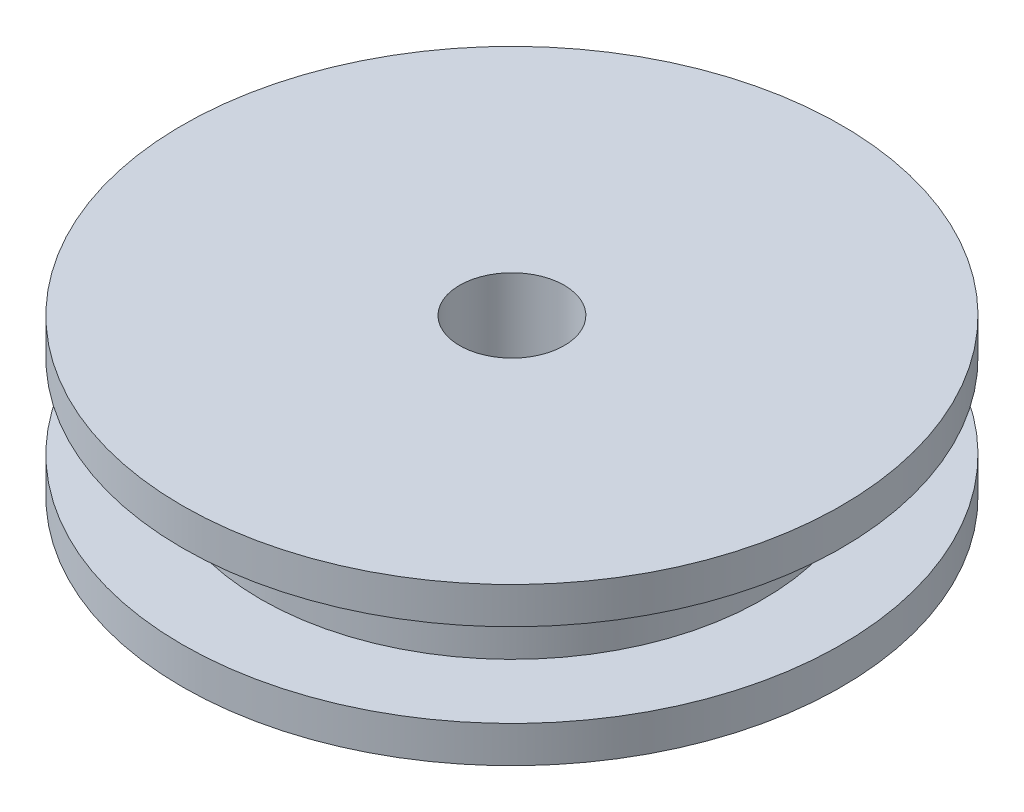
ISO-10303-21;
HEADER;
FILE_DESCRIPTION(('STEP AP214'),'2;1');
FILE_NAME('part.step','',(''),(''),'','','');
FILE_SCHEMA(('AUTOMOTIVE_DESIGN { 1 0 10303 214 1 1 1 1 }'));
ENDSEC;
DATA;
#1=APPLICATION_CONTEXT('core data for automotive mechanical design processes');
#2=APPLICATION_PROTOCOL_DEFINITION('international standard','automotive_design',2000,#1);
#3=PRODUCT_CONTEXT('',#1,'mechanical');
#4=PRODUCT('Part','Part','',(#3));
#5=PRODUCT_RELATED_PRODUCT_CATEGORY('part','',(#4));
#6=PRODUCT_DEFINITION_FORMATION('','',#4);
#7=PRODUCT_DEFINITION_CONTEXT('part definition',#1,'design');
#8=PRODUCT_DEFINITION('design','',#6,#7);
#9=PRODUCT_DEFINITION_SHAPE('','',#8);
#10=(LENGTH_UNIT() NAMED_UNIT(*) SI_UNIT(.MILLI.,.METRE.));
#11=(NAMED_UNIT(*) PLANE_ANGLE_UNIT() SI_UNIT($,.RADIAN.));
#12=(NAMED_UNIT(*) SI_UNIT($,.STERADIAN.) SOLID_ANGLE_UNIT());
#13=UNCERTAINTY_MEASURE_WITH_UNIT(LENGTH_MEASURE(1.E-05),#10,'distance_accuracy_value','');
#14=(GEOMETRIC_REPRESENTATION_CONTEXT(3) GLOBAL_UNCERTAINTY_ASSIGNED_CONTEXT((#13)) GLOBAL_UNIT_ASSIGNED_CONTEXT((#10,
#11,#12)) REPRESENTATION_CONTEXT('',''));
#15=CARTESIAN_POINT('',(0.,0.,0.));
#16=DIRECTION('',(0.,0.,1.));
#17=DIRECTION('',(1.,0.,0.));
#18=AXIS2_PLACEMENT_3D('',#15,#16,#17);
#19=CARTESIAN_POINT('',(0.,0.7,0.));
#20=DIRECTION('',(0.,1.,0.));
#21=DIRECTION('',(0.,0.,1.));
#22=AXIS2_PLACEMENT_3D('',#19,#20,#21);
#23=PLANE('',#22);
#24=CARTESIAN_POINT('',(0.,0.7,0.));
#25=DIRECTION('',(0.,1.,0.));
#26=DIRECTION('',(0.,0.,1.));
#27=AXIS2_PLACEMENT_3D('',#24,#25,#26);
#28=CIRCLE('',#27,6.3);
#29=CARTESIAN_POINT('',(0.,0.7,6.3));
#30=VERTEX_POINT('',#29);
#31=EDGE_CURVE('E12',#30,#30,#28,.T.);
#32=ORIENTED_EDGE('',*,*,#31,.T.);
#33=EDGE_LOOP('',(#32));
#34=FACE_BOUND('',#33,.T.);
#35=CARTESIAN_POINT('',(0.,0.7,0.));
#36=DIRECTION('',(0.,1.,0.));
#37=DIRECTION('',(0.,0.,1.));
#38=AXIS2_PLACEMENT_3D('',#35,#36,#37);
#39=CIRCLE('',#38,4.8);
#40=CARTESIAN_POINT('',(0.,0.7,4.8));
#41=VERTEX_POINT('',#40);
#42=EDGE_CURVE('E66',#41,#41,#39,.T.);
#43=ORIENTED_EDGE('',*,*,#42,.F.);
#44=EDGE_LOOP('',(#43));
#45=FACE_BOUND('',#44,.T.);
#46=ADVANCED_FACE('F53',(#34,#45),#23,.T.);
#47=CARTESIAN_POINT('',(0.,0.7,0.));
#48=DIRECTION('',(0.,-1.,0.));
#49=DIRECTION('',(0.,0.,-1.));
#50=AXIS2_PLACEMENT_3D('',#47,#48,#49);
#51=CYLINDRICAL_SURFACE('',#50,6.3);
#52=ORIENTED_EDGE('',*,*,#31,.F.);
#53=EDGE_LOOP('',(#52));
#54=FACE_BOUND('',#53,.T.);
#55=CARTESIAN_POINT('',(0.,0.,0.));
#56=DIRECTION('',(0.,1.,0.));
#57=DIRECTION('',(0.,0.,1.));
#58=AXIS2_PLACEMENT_3D('',#55,#56,#57);
#59=CIRCLE('',#58,6.3);
#60=CARTESIAN_POINT('',(0.,0.,6.3));
#61=VERTEX_POINT('',#60);
#62=EDGE_CURVE('E57',#61,#61,#59,.T.);
#63=ORIENTED_EDGE('',*,*,#62,.T.);
#64=EDGE_LOOP('',(#63));
#65=FACE_BOUND('',#64,.T.);
#66=ADVANCED_FACE('F55',(#54,#65),#51,.T.);
#67=CARTESIAN_POINT('',(0.,0.,0.));
#68=DIRECTION('',(0.,1.,0.));
#69=DIRECTION('',(0.,0.,1.));
#70=AXIS2_PLACEMENT_3D('',#67,#68,#69);
#71=PLANE('',#70);
#72=CARTESIAN_POINT('',(0.,0.,0.));
#73=DIRECTION('',(0.,-1.,0.));
#74=DIRECTION('',(0.,0.,-1.));
#75=AXIS2_PLACEMENT_3D('',#72,#73,#74);
#76=CIRCLE('',#75,1.);
#77=CARTESIAN_POINT('',(0.,0.,-1.));
#78=VERTEX_POINT('',#77);
#79=EDGE_CURVE('E75',#78,#78,#76,.T.);
#80=ORIENTED_EDGE('',*,*,#79,.F.);
#81=EDGE_LOOP('',(#80));
#82=FACE_BOUND('',#81,.T.);
#83=ORIENTED_EDGE('',*,*,#62,.F.);
#84=EDGE_LOOP('',(#83));
#85=FACE_BOUND('',#84,.T.);
#86=ADVANCED_FACE('F86',(#82,#85),#71,.F.);
#87=CARTESIAN_POINT('',(0.,2.3,0.));
#88=DIRECTION('',(0.,-1.,0.));
#89=DIRECTION('',(0.,0.,-1.));
#90=AXIS2_PLACEMENT_3D('',#87,#88,#89);
#91=CYLINDRICAL_SURFACE('',#90,4.8);
#92=CARTESIAN_POINT('',(0.,2.3,0.));
#93=DIRECTION('',(0.,1.,0.));
#94=DIRECTION('',(0.,0.,1.));
#95=AXIS2_PLACEMENT_3D('',#92,#93,#94);
#96=CIRCLE('',#95,4.8);
#97=CARTESIAN_POINT('',(0.,2.3,4.8));
#98=VERTEX_POINT('',#97);
#99=EDGE_CURVE('E64',#98,#98,#96,.T.);
#100=ORIENTED_EDGE('',*,*,#99,.F.);
#101=EDGE_LOOP('',(#100));
#102=FACE_BOUND('',#101,.T.);
#103=ORIENTED_EDGE('',*,*,#42,.T.);
#104=EDGE_LOOP('',(#103));
#105=FACE_BOUND('',#104,.T.);
#106=ADVANCED_FACE('F89',(#102,#105),#91,.T.);
#107=CARTESIAN_POINT('',(0.,2.3,0.));
#108=DIRECTION('',(0.,1.,0.));
#109=DIRECTION('',(0.,0.,1.));
#110=AXIS2_PLACEMENT_3D('',#107,#108,#109);
#111=PLANE('',#110);
#112=CARTESIAN_POINT('',(0.,2.3,0.));
#113=DIRECTION('',(0.,1.,0.));
#114=DIRECTION('',(0.,0.,1.));
#115=AXIS2_PLACEMENT_3D('',#112,#113,#114);
#116=CIRCLE('',#115,6.3);
#117=CARTESIAN_POINT('',(0.,2.3,6.3));
#118=VERTEX_POINT('',#117);
#119=EDGE_CURVE('E72',#118,#118,#116,.T.);
#120=ORIENTED_EDGE('',*,*,#119,.F.);
#121=EDGE_LOOP('',(#120));
#122=FACE_BOUND('',#121,.T.);
#123=ORIENTED_EDGE('',*,*,#99,.T.);
#124=EDGE_LOOP('',(#123));
#125=FACE_BOUND('',#124,.T.);
#126=ADVANCED_FACE('F104',(#122,#125),#111,.F.);
#127=CARTESIAN_POINT('',(0.,3.,0.));
#128=DIRECTION('',(0.,-1.,0.));
#129=DIRECTION('',(0.,0.,-1.));
#130=AXIS2_PLACEMENT_3D('',#127,#128,#129);
#131=CYLINDRICAL_SURFACE('',#130,6.3);
#132=CARTESIAN_POINT('',(0.,3.,0.));
#133=DIRECTION('',(0.,1.,0.));
#134=DIRECTION('',(0.,0.,1.));
#135=AXIS2_PLACEMENT_3D('',#132,#133,#134);
#136=CIRCLE('',#135,6.3);
#137=CARTESIAN_POINT('',(0.,3.,6.3));
#138=VERTEX_POINT('',#137);
#139=EDGE_CURVE('E69',#138,#138,#136,.T.);
#140=ORIENTED_EDGE('',*,*,#139,.F.);
#141=EDGE_LOOP('',(#140));
#142=FACE_BOUND('',#141,.T.);
#143=ORIENTED_EDGE('',*,*,#119,.T.);
#144=EDGE_LOOP('',(#143));
#145=FACE_BOUND('',#144,.T.);
#146=ADVANCED_FACE('F106',(#142,#145),#131,.T.);
#147=CARTESIAN_POINT('',(0.,3.,0.));
#148=DIRECTION('',(0.,1.,0.));
#149=DIRECTION('',(0.,0.,1.));
#150=AXIS2_PLACEMENT_3D('',#147,#148,#149);
#151=PLANE('',#150);
#152=CARTESIAN_POINT('',(0.,3.,0.));
#153=DIRECTION('',(0.,1.,0.));
#154=DIRECTION('',(0.,0.,1.));
#155=AXIS2_PLACEMENT_3D('',#152,#153,#154);
#156=CIRCLE('',#155,1.);
#157=CARTESIAN_POINT('',(0.,3.,-1.));
#158=VERTEX_POINT('',#157);
#159=EDGE_CURVE('E78',#158,#158,#156,.F.);
#160=ORIENTED_EDGE('',*,*,#159,.T.);
#161=EDGE_LOOP('',(#160));
#162=FACE_BOUND('',#161,.T.);
#163=ORIENTED_EDGE('',*,*,#139,.T.);
#164=EDGE_LOOP('',(#163));
#165=FACE_BOUND('',#164,.T.);
#166=ADVANCED_FACE('F109',(#162,#165),#151,.T.);
#167=CARTESIAN_POINT('',(0.,3.001,0.));
#168=DIRECTION('',(0.,-1.,0.));
#169=DIRECTION('',(0.,0.,-1.));
#170=AXIS2_PLACEMENT_3D('',#167,#168,#169);
#171=CYLINDRICAL_SURFACE('',#170,1.);
#172=CARTESIAN_POINT('',(0.,3.,-1.));
#173=CARTESIAN_POINT('',(0.,2.96875,-1.));
#174=CARTESIAN_POINT('',(0.,2.9375,-1.));
#175=CARTESIAN_POINT('',(0.,2.875,-1.));
#176=CARTESIAN_POINT('',(0.,2.84375,-1.));
#177=CARTESIAN_POINT('',(0.,2.78125,-1.));
#178=CARTESIAN_POINT('',(0.,2.75,-1.));
#179=CARTESIAN_POINT('',(0.,2.6875,-1.));
#180=CARTESIAN_POINT('',(0.,2.65625,-1.));
#181=CARTESIAN_POINT('',(0.,2.59375,-1.));
#182=CARTESIAN_POINT('',(0.,2.5625,-1.));
#183=CARTESIAN_POINT('',(0.,2.5,-1.));
#184=CARTESIAN_POINT('',(0.,2.46875,-1.));
#185=CARTESIAN_POINT('',(0.,2.40625,-1.));
#186=CARTESIAN_POINT('',(0.,2.375,-1.));
#187=CARTESIAN_POINT('',(0.,2.3125,-1.));
#188=CARTESIAN_POINT('',(0.,2.28125,-1.));
#189=CARTESIAN_POINT('',(0.,2.21875,-1.));
#190=CARTESIAN_POINT('',(0.,2.1875,-1.));
#191=CARTESIAN_POINT('',(0.,2.125,-1.));
#192=CARTESIAN_POINT('',(0.,2.09375,-1.));
#193=CARTESIAN_POINT('',(0.,2.03125,-1.));
#194=CARTESIAN_POINT('',(0.,2.,-1.));
#195=CARTESIAN_POINT('',(0.,1.9375,-1.));
#196=CARTESIAN_POINT('',(0.,1.90625,-1.));
#197=CARTESIAN_POINT('',(0.,1.84375,-1.));
#198=CARTESIAN_POINT('',(0.,1.8125,-1.));
#199=CARTESIAN_POINT('',(0.,1.75,-1.));
#200=CARTESIAN_POINT('',(0.,1.71875,-1.));
#201=CARTESIAN_POINT('',(0.,1.65625,-1.));
#202=CARTESIAN_POINT('',(0.,1.625,-1.));
#203=CARTESIAN_POINT('',(0.,1.5625,-1.));
#204=CARTESIAN_POINT('',(0.,1.53125,-1.));
#205=CARTESIAN_POINT('',(0.,1.46875,-1.));
#206=CARTESIAN_POINT('',(0.,1.4375,-1.));
#207=CARTESIAN_POINT('',(0.,1.375,-1.));
#208=CARTESIAN_POINT('',(0.,1.34375,-1.));
#209=CARTESIAN_POINT('',(0.,1.28125,-1.));
#210=CARTESIAN_POINT('',(0.,1.25,-1.));
#211=CARTESIAN_POINT('',(0.,1.1875,-1.));
#212=CARTESIAN_POINT('',(0.,1.15625,-1.));
#213=CARTESIAN_POINT('',(0.,1.09375,-1.));
#214=CARTESIAN_POINT('',(0.,1.0625,-1.));
#215=CARTESIAN_POINT('',(0.,1.,-1.));
#216=CARTESIAN_POINT('',(0.,0.96875,-1.));
#217=CARTESIAN_POINT('',(0.,0.90625,-1.));
#218=CARTESIAN_POINT('',(0.,0.875,-1.));
#219=CARTESIAN_POINT('',(0.,0.8125,-1.));
#220=CARTESIAN_POINT('',(0.,0.78125,-1.));
#221=CARTESIAN_POINT('',(0.,0.71875,-1.));
#222=CARTESIAN_POINT('',(0.,0.6875,-1.));
#223=CARTESIAN_POINT('',(0.,0.625,-1.));
#224=CARTESIAN_POINT('',(0.,0.59375,-1.));
#225=CARTESIAN_POINT('',(0.,0.53125,-1.));
#226=CARTESIAN_POINT('',(0.,0.5,-1.));
#227=CARTESIAN_POINT('',(0.,0.4375,-1.));
#228=CARTESIAN_POINT('',(0.,0.40625,-1.));
#229=CARTESIAN_POINT('',(0.,0.34375,-1.));
#230=CARTESIAN_POINT('',(0.,0.3125,-1.));
#231=CARTESIAN_POINT('',(0.,0.25,-1.));
#232=CARTESIAN_POINT('',(0.,0.21875,-1.));
#233=CARTESIAN_POINT('',(0.,0.156250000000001,-1.));
#234=CARTESIAN_POINT('',(0.,0.125000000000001,-1.));
#235=CARTESIAN_POINT('',(0.,0.0625000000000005,-1.));
#236=CARTESIAN_POINT('',(0.,0.0312500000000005,-1.));
#237=CARTESIAN_POINT('',(0.,0.,-1.));
#238=B_SPLINE_CURVE_WITH_KNOTS('',3,(#172,#173,#174,#175,#176,#177,#178,#179,#180,#181,#182,
#183,#184,#185,#186,#187,#188,#189,#190,#191,#192,#193,#194,#195,#196,#197,#198,#199,#200,#201,
#202,#203,#204,#205,#206,#207,#208,#209,#210,#211,#212,#213,#214,#215,#216,#217,#218,#219,#220,
#221,#222,#223,#224,#225,#226,#227,#228,#229,#230,#231,#232,#233,#234,#235,#236,#237),
.UNSPECIFIED.,.F.,.F.,(4,2,2,2,2,2,2,2,2,2,2,2,2,2,2,2,2,2,2,2,2,2,2,2,2,2,2,2,2,2,2,2,4),(0.,
0.0937499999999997,0.1875,0.28125,0.375,0.46875,0.5625,0.65625,0.749999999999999,
0.843749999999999,0.9375,1.03125,1.125,1.21875,1.3125,1.40625,1.5,1.59375,1.6875,1.78125,1.875,
1.96875,2.0625,2.15625,2.25,2.34375,2.4375,2.53125,2.625,2.71875,2.8125,2.90625,3.),.UNSPECIFIED.);
#239=EDGE_CURVE('BSEAM84',#158,#78,#238,.T.);
#240=ORIENTED_EDGE('',*,*,#159,.F.);
#241=ORIENTED_EDGE('',*,*,#79,.T.);
#242=ORIENTED_EDGE('',*,*,#239,.T.);
#243=ORIENTED_EDGE('',*,*,#239,.F.);
#244=EDGE_LOOP('',(#240,#242,#241,#243));
#245=FACE_BOUND('',#244,.T.);
#246=ADVANCED_FACE('F84',(#245),#171,.F.);
#247=CLOSED_SHELL('',(#46,#66,#86,#106,#126,#146,#166,#246));
#248=MANIFOLD_SOLID_BREP('B2',#247);
#249=ADVANCED_BREP_SHAPE_REPRESENTATION('',(#18,#248),#14);
#250=SHAPE_DEFINITION_REPRESENTATION(#9,#249);
ENDSEC;
END-ISO-10303-21;
